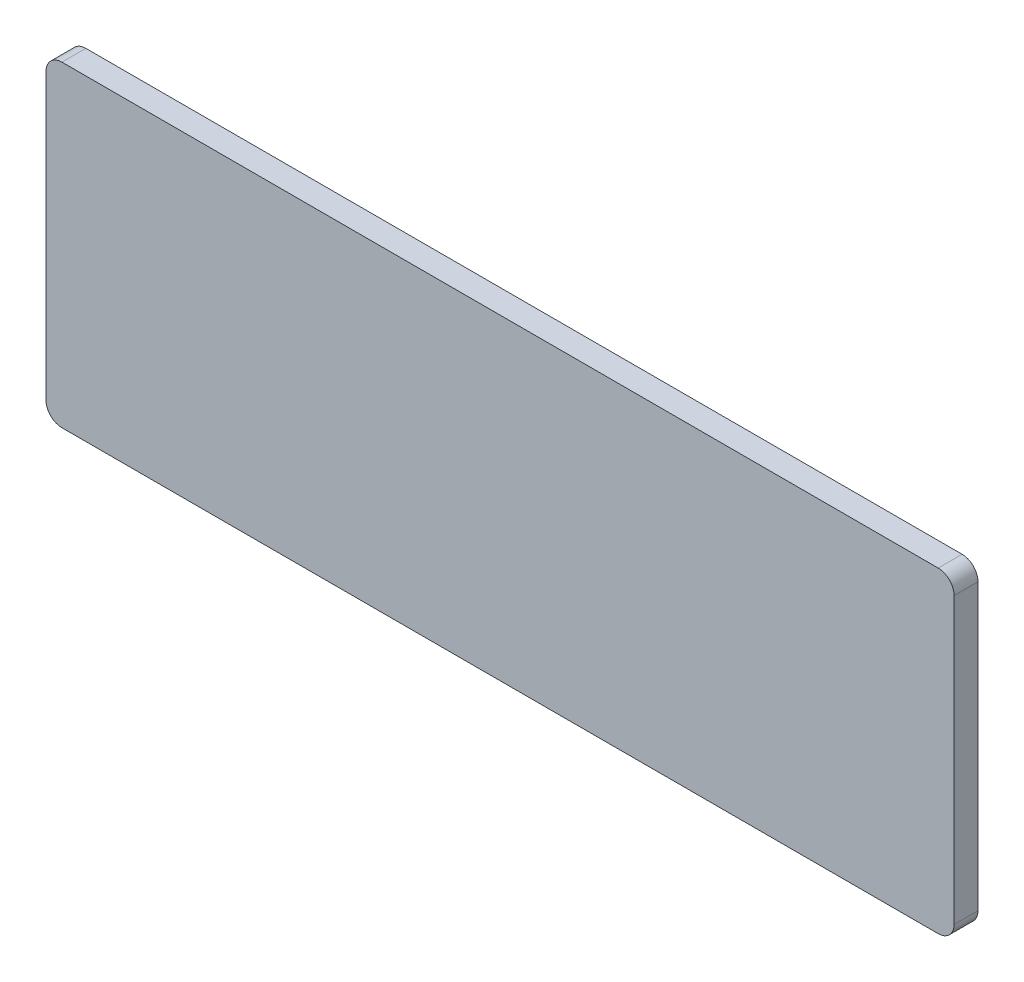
ISO-10303-21;
HEADER;
FILE_DESCRIPTION(('STEP AP214'),'2;1');
FILE_NAME('part.step','',(''),(''),'','','');
FILE_SCHEMA(('AUTOMOTIVE_DESIGN { 1 0 10303 214 1 1 1 1 }'));
ENDSEC;
DATA;
#1=APPLICATION_CONTEXT('core data for automotive mechanical design processes');
#2=APPLICATION_PROTOCOL_DEFINITION('international standard','automotive_design',2000,#1);
#3=PRODUCT_CONTEXT('',#1,'mechanical');
#4=PRODUCT('Part','Part','',(#3));
#5=PRODUCT_RELATED_PRODUCT_CATEGORY('part','',(#4));
#6=PRODUCT_DEFINITION_FORMATION('','',#4);
#7=PRODUCT_DEFINITION_CONTEXT('part definition',#1,'design');
#8=PRODUCT_DEFINITION('design','',#6,#7);
#9=PRODUCT_DEFINITION_SHAPE('','',#8);
#10=(LENGTH_UNIT() NAMED_UNIT(*) SI_UNIT(.MILLI.,.METRE.));
#11=(NAMED_UNIT(*) PLANE_ANGLE_UNIT() SI_UNIT($,.RADIAN.));
#12=(NAMED_UNIT(*) SI_UNIT($,.STERADIAN.) SOLID_ANGLE_UNIT());
#13=UNCERTAINTY_MEASURE_WITH_UNIT(LENGTH_MEASURE(1.E-05),#10,'distance_accuracy_value','');
#14=(GEOMETRIC_REPRESENTATION_CONTEXT(3) GLOBAL_UNCERTAINTY_ASSIGNED_CONTEXT((#13)) GLOBAL_UNIT_ASSIGNED_CONTEXT((#10,
#11,#12)) REPRESENTATION_CONTEXT('',''));
#15=CARTESIAN_POINT('',(0.,0.,0.));
#16=DIRECTION('',(0.,0.,1.));
#17=DIRECTION('',(1.,0.,0.));
#18=AXIS2_PLACEMENT_3D('',#15,#16,#17);
#19=CARTESIAN_POINT('',(114.,-40.,3.));
#20=DIRECTION('',(-1.,0.,0.));
#21=DIRECTION('',(0.,0.,1.));
#22=AXIS2_PLACEMENT_3D('',#19,#20,#21);
#23=PLANE('',#22);
#24=DIRECTION('',(0.,1.,0.));
#25=VECTOR('',#24,1.);
#26=CARTESIAN_POINT('',(114.,-40.,0.));
#27=LINE('',#26,#25);
#28=CARTESIAN_POINT('',(114.,-37.75,0.));
#29=VERTEX_POINT('',#28);
#30=CARTESIAN_POINT('',(114.,-2.,0.));
#31=VERTEX_POINT('',#30);
#32=EDGE_CURVE('E140',#29,#31,#27,.T.);
#33=ORIENTED_EDGE('',*,*,#32,.T.);
#34=DIRECTION('',(0.,0.,-1.));
#35=VECTOR('',#34,1.);
#36=CARTESIAN_POINT('',(114.,-2.,3.));
#37=LINE('',#36,#35);
#38=CARTESIAN_POINT('',(114.,-2.,3.));
#39=VERTEX_POINT('',#38);
#40=EDGE_CURVE('E116',#31,#39,#37,.F.);
#41=ORIENTED_EDGE('',*,*,#40,.T.);
#42=DIRECTION('',(0.,1.,0.));
#43=VECTOR('',#42,1.);
#44=CARTESIAN_POINT('',(114.,-40.,3.));
#45=LINE('',#44,#43);
#46=CARTESIAN_POINT('',(114.,-37.75,3.));
#47=VERTEX_POINT('',#46);
#48=EDGE_CURVE('E145',#47,#39,#45,.T.);
#49=ORIENTED_EDGE('',*,*,#48,.F.);
#50=DIRECTION('',(0.,0.,1.));
#51=VECTOR('',#50,1.);
#52=CARTESIAN_POINT('',(114.,-37.75,3.));
#53=LINE('',#52,#51);
#54=EDGE_CURVE('E122',#47,#29,#53,.F.);
#55=ORIENTED_EDGE('',*,*,#54,.T.);
#56=EDGE_LOOP('',(#33,#41,#49,#55));
#57=FACE_BOUND('',#56,.T.);
#58=ADVANCED_FACE('F43',(#57),#23,.F.);
#59=CARTESIAN_POINT('',(114.,0.,3.));
#60=DIRECTION('',(0.,-1.,0.));
#61=DIRECTION('',(1.,0.,0.));
#62=AXIS2_PLACEMENT_3D('',#59,#60,#61);
#63=PLANE('',#62);
#64=DIRECTION('',(-1.,0.,0.));
#65=VECTOR('',#64,1.);
#66=CARTESIAN_POINT('',(114.,0.,3.));
#67=LINE('',#66,#65);
#68=CARTESIAN_POINT('',(112.,0.,3.));
#69=VERTEX_POINT('',#68);
#70=CARTESIAN_POINT('',(2.00000000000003,0.,3.));
#71=VERTEX_POINT('',#70);
#72=EDGE_CURVE('E131',#69,#71,#67,.T.);
#73=ORIENTED_EDGE('',*,*,#72,.F.);
#74=DIRECTION('',(0.,0.,-1.));
#75=VECTOR('',#74,1.);
#76=CARTESIAN_POINT('',(112.,0.,3.));
#77=LINE('',#76,#75);
#78=CARTESIAN_POINT('',(112.,0.,0.));
#79=VERTEX_POINT('',#78);
#80=EDGE_CURVE('E115',#69,#79,#77,.T.);
#81=ORIENTED_EDGE('',*,*,#80,.T.);
#82=DIRECTION('',(-1.,0.,0.));
#83=VECTOR('',#82,1.);
#84=CARTESIAN_POINT('',(114.,0.,0.));
#85=LINE('',#84,#83);
#86=CARTESIAN_POINT('',(2.00000000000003,0.,0.));
#87=VERTEX_POINT('',#86);
#88=EDGE_CURVE('E129',#79,#87,#85,.T.);
#89=ORIENTED_EDGE('',*,*,#88,.T.);
#90=DIRECTION('',(0.,0.,-1.));
#91=VECTOR('',#90,1.);
#92=CARTESIAN_POINT('',(2.,0.,3.));
#93=LINE('',#92,#91);
#94=EDGE_CURVE('E134',#87,#71,#93,.F.);
#95=ORIENTED_EDGE('',*,*,#94,.T.);
#96=EDGE_LOOP('',(#73,#81,#89,#95));
#97=FACE_BOUND('',#96,.T.);
#98=ADVANCED_FACE('F128',(#97),#63,.F.);
#99=CARTESIAN_POINT('',(0.,0.,3.));
#100=DIRECTION('',(1.,0.,0.));
#101=DIRECTION('',(0.,1.,0.));
#102=AXIS2_PLACEMENT_3D('',#99,#100,#101);
#103=PLANE('',#102);
#104=DIRECTION('',(0.,-1.,0.));
#105=VECTOR('',#104,1.);
#106=CARTESIAN_POINT('',(0.,0.,0.));
#107=LINE('',#106,#105);
#108=CARTESIAN_POINT('',(0.,-2.,0.));
#109=VERTEX_POINT('',#108);
#110=CARTESIAN_POINT('',(0.,-37.75,0.));
#111=VERTEX_POINT('',#110);
#112=EDGE_CURVE('E139',#109,#111,#107,.T.);
#113=ORIENTED_EDGE('',*,*,#112,.T.);
#114=DIRECTION('',(0.,0.,1.));
#115=VECTOR('',#114,1.);
#116=CARTESIAN_POINT('',(0.,-37.75,3.));
#117=LINE('',#116,#115);
#118=CARTESIAN_POINT('',(0.,-37.75,3.));
#119=VERTEX_POINT('',#118);
#120=EDGE_CURVE('E11',#111,#119,#117,.T.);
#121=ORIENTED_EDGE('',*,*,#120,.T.);
#122=DIRECTION('',(0.,-1.,0.));
#123=VECTOR('',#122,1.);
#124=CARTESIAN_POINT('',(0.,0.,3.));
#125=LINE('',#124,#123);
#126=CARTESIAN_POINT('',(0.,-2.,3.));
#127=VERTEX_POINT('',#126);
#128=EDGE_CURVE('E152',#127,#119,#125,.T.);
#129=ORIENTED_EDGE('',*,*,#128,.F.);
#130=DIRECTION('',(0.,0.,-1.));
#131=VECTOR('',#130,1.);
#132=CARTESIAN_POINT('',(0.,-2.,3.));
#133=LINE('',#132,#131);
#134=EDGE_CURVE('E52',#127,#109,#133,.T.);
#135=ORIENTED_EDGE('',*,*,#134,.T.);
#136=EDGE_LOOP('',(#113,#121,#129,#135));
#137=FACE_BOUND('',#136,.T.);
#138=ADVANCED_FACE('F185',(#137),#103,.F.);
#139=CARTESIAN_POINT('',(0.,0.,3.));
#140=DIRECTION('',(0.,0.,1.));
#141=DIRECTION('',(1.,0.,0.));
#142=AXIS2_PLACEMENT_3D('',#139,#140,#141);
#143=PLANE('',#142);
#144=ORIENTED_EDGE('',*,*,#48,.T.);
#145=CARTESIAN_POINT('',(112.,-2.,3.));
#146=DIRECTION('',(0.,0.,1.));
#147=DIRECTION('',(1.,0.,0.));
#148=AXIS2_PLACEMENT_3D('',#145,#146,#147);
#149=CIRCLE('',#148,2.);
#150=EDGE_CURVE('E172',#39,#69,#149,.T.);
#151=ORIENTED_EDGE('',*,*,#150,.T.);
#152=ORIENTED_EDGE('',*,*,#72,.T.);
#153=CARTESIAN_POINT('',(2.,-2.,3.));
#154=DIRECTION('',(0.,0.,1.));
#155=DIRECTION('',(1.,0.,0.));
#156=AXIS2_PLACEMENT_3D('',#153,#154,#155);
#157=CIRCLE('',#156,2.);
#158=EDGE_CURVE('E66',#71,#127,#157,.T.);
#159=ORIENTED_EDGE('',*,*,#158,.T.);
#160=ORIENTED_EDGE('',*,*,#128,.T.);
#161=CARTESIAN_POINT('',(2.,-37.75,3.));
#162=DIRECTION('',(0.,0.,1.));
#163=DIRECTION('',(1.,0.,0.));
#164=AXIS2_PLACEMENT_3D('',#161,#162,#163);
#165=CIRCLE('',#164,2.);
#166=CARTESIAN_POINT('',(2.,-39.75,3.));
#167=VERTEX_POINT('',#166);
#168=EDGE_CURVE('E59',#119,#167,#165,.T.);
#169=ORIENTED_EDGE('',*,*,#168,.T.);
#170=DIRECTION('',(-1.,0.,0.));
#171=VECTOR('',#170,1.);
#172=CARTESIAN_POINT('',(0.,-39.75,3.));
#173=LINE('',#172,#171);
#174=CARTESIAN_POINT('',(112.,-39.75,3.));
#175=VERTEX_POINT('',#174);
#176=EDGE_CURVE('E201',#175,#167,#173,.T.);
#177=ORIENTED_EDGE('',*,*,#176,.F.);
#178=CARTESIAN_POINT('',(112.,-37.75,3.));
#179=DIRECTION('',(0.,0.,1.));
#180=DIRECTION('',(1.,0.,0.));
#181=AXIS2_PLACEMENT_3D('',#178,#179,#180);
#182=CIRCLE('',#181,2.);
#183=EDGE_CURVE('E169',#175,#47,#182,.T.);
#184=ORIENTED_EDGE('',*,*,#183,.T.);
#185=EDGE_LOOP('',(#144,#151,#152,#159,#160,#169,#177,#184));
#186=FACE_BOUND('',#185,.T.);
#187=ADVANCED_FACE('F192',(#186),#143,.T.);
#188=CARTESIAN_POINT('',(0.,0.,0.));
#189=DIRECTION('',(0.,0.,1.));
#190=DIRECTION('',(1.,0.,0.));
#191=AXIS2_PLACEMENT_3D('',#188,#189,#190);
#192=PLANE('',#191);
#193=ORIENTED_EDGE('',*,*,#88,.F.);
#194=CARTESIAN_POINT('',(112.,-2.,0.));
#195=DIRECTION('',(0.,0.,1.));
#196=DIRECTION('',(1.,0.,0.));
#197=AXIS2_PLACEMENT_3D('',#194,#195,#196);
#198=CIRCLE('',#197,2.);
#199=EDGE_CURVE('E111',#79,#31,#198,.F.);
#200=ORIENTED_EDGE('',*,*,#199,.T.);
#201=ORIENTED_EDGE('',*,*,#32,.F.);
#202=CARTESIAN_POINT('',(112.,-37.75,0.));
#203=DIRECTION('',(0.,0.,1.));
#204=DIRECTION('',(1.,0.,0.));
#205=AXIS2_PLACEMENT_3D('',#202,#203,#204);
#206=CIRCLE('',#205,2.);
#207=CARTESIAN_POINT('',(112.,-39.75,0.));
#208=VERTEX_POINT('',#207);
#209=EDGE_CURVE('E123',#29,#208,#206,.F.);
#210=ORIENTED_EDGE('',*,*,#209,.T.);
#211=DIRECTION('',(-1.,0.,0.));
#212=VECTOR('',#211,1.);
#213=CARTESIAN_POINT('',(0.,-39.75,0.));
#214=LINE('',#213,#212);
#215=CARTESIAN_POINT('',(2.,-39.75,0.));
#216=VERTEX_POINT('',#215);
#217=EDGE_CURVE('E147',#208,#216,#214,.T.);
#218=ORIENTED_EDGE('',*,*,#217,.T.);
#219=CARTESIAN_POINT('',(2.,-37.75,0.));
#220=DIRECTION('',(0.,0.,1.));
#221=DIRECTION('',(1.,0.,0.));
#222=AXIS2_PLACEMENT_3D('',#219,#220,#221);
#223=CIRCLE('',#222,2.);
#224=EDGE_CURVE('E156',#216,#111,#223,.F.);
#225=ORIENTED_EDGE('',*,*,#224,.T.);
#226=ORIENTED_EDGE('',*,*,#112,.F.);
#227=CARTESIAN_POINT('',(2.,-2.,0.));
#228=DIRECTION('',(0.,0.,1.));
#229=DIRECTION('',(1.,0.,0.));
#230=AXIS2_PLACEMENT_3D('',#227,#228,#229);
#231=CIRCLE('',#230,2.);
#232=EDGE_CURVE('E133',#109,#87,#231,.F.);
#233=ORIENTED_EDGE('',*,*,#232,.T.);
#234=EDGE_LOOP('',(#193,#200,#201,#210,#218,#225,#226,#233));
#235=FACE_BOUND('',#234,.T.);
#236=ADVANCED_FACE('F136',(#235),#192,.F.);
#237=CARTESIAN_POINT('',(0.,-39.75,0.));
#238=DIRECTION('',(0.,1.,0.));
#239=DIRECTION('',(0.,0.,1.));
#240=AXIS2_PLACEMENT_3D('',#237,#238,#239);
#241=PLANE('',#240);
#242=ORIENTED_EDGE('',*,*,#217,.F.);
#243=DIRECTION('',(0.,0.,1.));
#244=VECTOR('',#243,1.);
#245=CARTESIAN_POINT('',(112.,-39.75,0.));
#246=LINE('',#245,#244);
#247=EDGE_CURVE('E178',#208,#175,#246,.T.);
#248=ORIENTED_EDGE('',*,*,#247,.T.);
#249=ORIENTED_EDGE('',*,*,#176,.T.);
#250=DIRECTION('',(0.,0.,1.));
#251=VECTOR('',#250,1.);
#252=CARTESIAN_POINT('',(2.,-39.75,0.));
#253=LINE('',#252,#251);
#254=EDGE_CURVE('E175',#167,#216,#253,.F.);
#255=ORIENTED_EDGE('',*,*,#254,.T.);
#256=EDGE_LOOP('',(#242,#248,#249,#255));
#257=FACE_BOUND('',#256,.T.);
#258=ADVANCED_FACE('F206',(#257),#241,.F.);
#259=CARTESIAN_POINT('',(112.,-2.,3.));
#260=DIRECTION('',(0.,0.,-1.));
#261=DIRECTION('',(-1.,0.,0.));
#262=AXIS2_PLACEMENT_3D('',#259,#260,#261);
#263=CYLINDRICAL_SURFACE('',#262,2.);
#264=ORIENTED_EDGE('',*,*,#150,.F.);
#265=ORIENTED_EDGE('',*,*,#40,.F.);
#266=ORIENTED_EDGE('',*,*,#199,.F.);
#267=ORIENTED_EDGE('',*,*,#80,.F.);
#268=EDGE_LOOP('',(#264,#265,#266,#267));
#269=FACE_BOUND('',#268,.T.);
#270=ADVANCED_FACE('F114',(#269),#263,.T.);
#271=CARTESIAN_POINT('',(112.,-37.75,0.));
#272=DIRECTION('',(0.,0.,1.));
#273=DIRECTION('',(1.,0.,0.));
#274=AXIS2_PLACEMENT_3D('',#271,#272,#273);
#275=CYLINDRICAL_SURFACE('',#274,2.);
#276=ORIENTED_EDGE('',*,*,#209,.F.);
#277=ORIENTED_EDGE('',*,*,#54,.F.);
#278=ORIENTED_EDGE('',*,*,#183,.F.);
#279=ORIENTED_EDGE('',*,*,#247,.F.);
#280=EDGE_LOOP('',(#276,#277,#278,#279));
#281=FACE_BOUND('',#280,.T.);
#282=ADVANCED_FACE('F213',(#281),#275,.T.);
#283=CARTESIAN_POINT('',(2.,-37.75,3.));
#284=DIRECTION('',(0.,0.,1.));
#285=DIRECTION('',(1.,0.,0.));
#286=AXIS2_PLACEMENT_3D('',#283,#284,#285);
#287=CYLINDRICAL_SURFACE('',#286,2.);
#288=ORIENTED_EDGE('',*,*,#224,.F.);
#289=ORIENTED_EDGE('',*,*,#254,.F.);
#290=ORIENTED_EDGE('',*,*,#168,.F.);
#291=ORIENTED_EDGE('',*,*,#120,.F.);
#292=EDGE_LOOP('',(#288,#289,#290,#291));
#293=FACE_BOUND('',#292,.T.);
#294=ADVANCED_FACE('F190',(#293),#287,.T.);
#295=CARTESIAN_POINT('',(2.,-2.,3.));
#296=DIRECTION('',(0.,0.,-1.));
#297=DIRECTION('',(-1.,0.,0.));
#298=AXIS2_PLACEMENT_3D('',#295,#296,#297);
#299=CYLINDRICAL_SURFACE('',#298,2.);
#300=ORIENTED_EDGE('',*,*,#158,.F.);
#301=ORIENTED_EDGE('',*,*,#94,.F.);
#302=ORIENTED_EDGE('',*,*,#232,.F.);
#303=ORIENTED_EDGE('',*,*,#134,.F.);
#304=EDGE_LOOP('',(#300,#301,#302,#303));
#305=FACE_BOUND('',#304,.T.);
#306=ADVANCED_FACE('F45',(#305),#299,.T.);
#307=CLOSED_SHELL('',(#58,#98,#138,#187,#236,#258,#270,#282,#294,#306));
#308=MANIFOLD_SOLID_BREP('B2',#307);
#309=ADVANCED_BREP_SHAPE_REPRESENTATION('',(#18,#308),#14);
#310=SHAPE_DEFINITION_REPRESENTATION(#9,#309);
ENDSEC;
END-ISO-10303-21;
